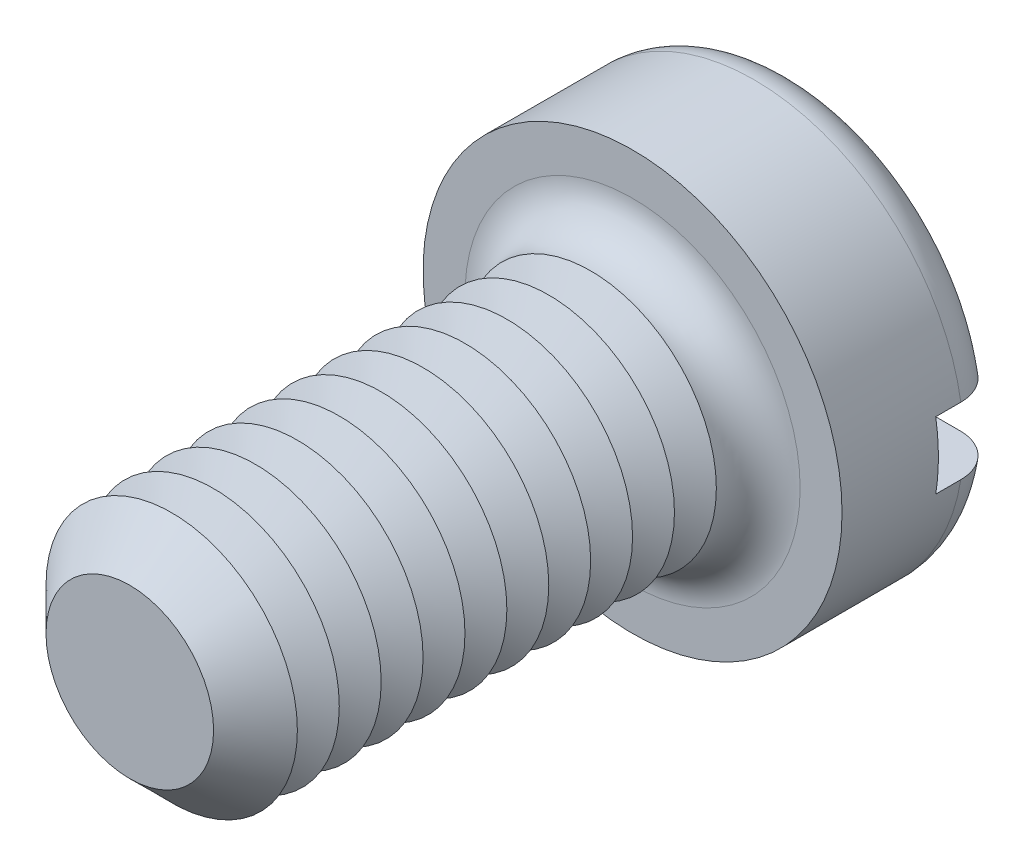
ISO-10303-21;
HEADER;
FILE_DESCRIPTION(('STEP AP214'),'2;1');
FILE_NAME('part.step','',(''),(''),'','','');
FILE_SCHEMA(('AUTOMOTIVE_DESIGN { 1 0 10303 214 1 1 1 1 }'));
ENDSEC;
DATA;
#1=APPLICATION_CONTEXT('core data for automotive mechanical design processes');
#2=APPLICATION_PROTOCOL_DEFINITION('international standard','automotive_design',2000,#1);
#3=PRODUCT_CONTEXT('',#1,'mechanical');
#4=PRODUCT('Part','Part','',(#3));
#5=PRODUCT_RELATED_PRODUCT_CATEGORY('part','',(#4));
#6=PRODUCT_DEFINITION_FORMATION('','',#4);
#7=PRODUCT_DEFINITION_CONTEXT('part definition',#1,'design');
#8=PRODUCT_DEFINITION('design','',#6,#7);
#9=PRODUCT_DEFINITION_SHAPE('','',#8);
#10=(LENGTH_UNIT() NAMED_UNIT(*) SI_UNIT(.MILLI.,.METRE.));
#11=(NAMED_UNIT(*) PLANE_ANGLE_UNIT() SI_UNIT($,.RADIAN.));
#12=(NAMED_UNIT(*) SI_UNIT($,.STERADIAN.) SOLID_ANGLE_UNIT());
#13=UNCERTAINTY_MEASURE_WITH_UNIT(LENGTH_MEASURE(1.E-05),#10,'distance_accuracy_value','');
#14=(GEOMETRIC_REPRESENTATION_CONTEXT(3) GLOBAL_UNCERTAINTY_ASSIGNED_CONTEXT((#13)) GLOBAL_UNIT_ASSIGNED_CONTEXT((#10,
#11,#12)) REPRESENTATION_CONTEXT('',''));
#15=CARTESIAN_POINT('',(0.,0.,0.));
#16=DIRECTION('',(0.,0.,1.));
#17=DIRECTION('',(1.,0.,0.));
#18=AXIS2_PLACEMENT_3D('',#15,#16,#17);
#19=CARTESIAN_POINT('',(0.,0.,-3.9));
#20=DIRECTION('',(0.,0.,1.));
#21=DIRECTION('',(1.,0.,0.));
#22=AXIS2_PLACEMENT_3D('',#19,#20,#21);
#23=PLANE('',#22);
#24=CARTESIAN_POINT('',(0.,0.,-3.9));
#25=DIRECTION('',(0.,0.,1.));
#26=DIRECTION('',(1.,0.,0.));
#27=AXIS2_PLACEMENT_3D('',#24,#25,#26);
#28=CIRCLE('',#27,4.);
#29=CARTESIAN_POINT('',(-3.91918358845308,0.800000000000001,-3.9));
#30=VERTEX_POINT('',#29);
#31=CARTESIAN_POINT('',(3.91918358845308,0.8,-3.9));
#32=VERTEX_POINT('',#31);
#33=EDGE_CURVE('E116',#30,#32,#28,.F.);
#34=ORIENTED_EDGE('',*,*,#33,.T.);
#35=DIRECTION('',(1.,0.,0.));
#36=VECTOR('',#35,1.);
#37=CARTESIAN_POINT('',(-5.,0.800000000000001,-3.9));
#38=LINE('',#37,#36);
#39=EDGE_CURVE('E111',#30,#32,#38,.T.);
#40=ORIENTED_EDGE('',*,*,#39,.F.);
#41=EDGE_LOOP('',(#34,#40));
#42=FACE_BOUND('',#41,.T.);
#43=ADVANCED_FACE('F39',(#42),#23,.F.);
#44=CARTESIAN_POINT('',(0.,0.,-2.9));
#45=DIRECTION('',(0.,0.,1.));
#46=DIRECTION('',(1.,0.,0.));
#47=AXIS2_PLACEMENT_3D('',#44,#45,#46);
#48=TOROIDAL_SURFACE('',#47,4.,1.);
#49=CARTESIAN_POINT('',(-4.76648512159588,0.800000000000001,-3.45304061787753));
#50=CARTESIAN_POINT('',(-4.73486405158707,0.800000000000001,-3.50001565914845));
#51=CARTESIAN_POINT('',(-4.69920787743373,0.800000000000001,-3.54432871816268));
#52=CARTESIAN_POINT('',(-4.62090302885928,0.800000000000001,-3.62634638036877));
#53=CARTESIAN_POINT('',(-4.57824494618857,0.800000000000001,-3.66404194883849));
#54=CARTESIAN_POINT('',(-4.48726975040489,0.800000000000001,-3.73172278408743));
#55=CARTESIAN_POINT('',(-4.43895902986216,0.800000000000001,-3.76171664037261));
#56=CARTESIAN_POINT('',(-4.33804923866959,0.800000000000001,-3.81326437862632));
#57=CARTESIAN_POINT('',(-4.2854512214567,0.800000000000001,-3.8348203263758));
#58=CARTESIAN_POINT('',(-4.17679895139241,0.800000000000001,-3.86918431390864));
#59=CARTESIAN_POINT('',(-4.12071163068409,0.800000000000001,-3.88188775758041));
#60=CARTESIAN_POINT('',(-4.00720729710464,0.800000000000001,-3.89785932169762));
#61=CARTESIAN_POINT('',(-3.94979011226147,0.800000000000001,-3.9011262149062));
#62=CARTESIAN_POINT('',(-3.83429042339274,0.800000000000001,-3.89816676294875));
#63=CARTESIAN_POINT('',(-3.77621176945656,0.800000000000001,-3.89178937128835));
#64=CARTESIAN_POINT('',(-3.66191938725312,0.800000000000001,-3.8694726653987));
#65=CARTESIAN_POINT('',(-3.60570580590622,0.800000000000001,-3.85353259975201));
#66=CARTESIAN_POINT('',(-3.49618749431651,0.800000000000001,-3.81233202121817));
#67=CARTESIAN_POINT('',(-3.44291561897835,0.800000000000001,-3.78698406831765));
#68=CARTESIAN_POINT('',(-3.34140774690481,0.800000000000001,-3.72766098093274));
#69=CARTESIAN_POINT('',(-3.29317182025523,0.800000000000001,-3.69368572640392));
#70=CARTESIAN_POINT('',(-3.20343355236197,0.800000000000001,-3.6182054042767));
#71=CARTESIAN_POINT('',(-3.16189680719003,0.800000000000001,-3.57674128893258));
#72=CARTESIAN_POINT('',(-3.08658236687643,0.800000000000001,-3.48727547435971));
#73=CARTESIAN_POINT('',(-3.05280364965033,0.800000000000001,-3.43927463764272));
#74=CARTESIAN_POINT('',(-2.99489532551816,0.800000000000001,-3.33932895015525));
#75=CARTESIAN_POINT('',(-2.97055012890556,0.800000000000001,-3.28750911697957));
#76=CARTESIAN_POINT('',(-2.93124252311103,0.800000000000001,-3.18042600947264));
#77=CARTESIAN_POINT('',(-2.91627793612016,0.800000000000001,-3.12516353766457));
#78=CARTESIAN_POINT('',(-2.89663075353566,0.800000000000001,-3.01470560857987));
#79=CARTESIAN_POINT('',(-2.89162828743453,0.800000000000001,-2.95956691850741));
#80=CARTESIAN_POINT('',(-2.89112479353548,0.800000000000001,-2.84924961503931));
#81=CARTESIAN_POINT('',(-2.89562264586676,0.800000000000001,-2.79407100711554));
#82=CARTESIAN_POINT('',(-2.91379565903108,0.800000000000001,-2.6861912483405));
#83=CARTESIAN_POINT('',(-2.92731815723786,0.800000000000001,-2.63346424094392));
#84=CARTESIAN_POINT('',(-2.96290888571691,0.800000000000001,-2.53098203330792));
#85=CARTESIAN_POINT('',(-2.98497757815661,0.800000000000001,-2.48122699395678));
#86=CARTESIAN_POINT('',(-3.03728055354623,0.800000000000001,-2.38535286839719));
#87=CARTESIAN_POINT('',(-3.06761989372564,0.800000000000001,-2.33929117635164));
#88=CARTESIAN_POINT('',(-3.13537950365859,0.800000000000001,-2.2527125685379));
#89=CARTESIAN_POINT('',(-3.17280082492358,0.800000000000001,-2.21219647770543));
#90=CARTESIAN_POINT('',(-3.2549164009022,0.800000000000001,-2.13651195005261));
#91=CARTESIAN_POINT('',(-3.29980186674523,0.800000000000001,-2.10155095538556));
#92=CARTESIAN_POINT('',(-3.39467666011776,0.800000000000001,-2.03942270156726));
#93=CARTESIAN_POINT('',(-3.44466673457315,0.800000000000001,-2.01225658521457));
#94=CARTESIAN_POINT('',(-3.5497933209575,0.800000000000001,-1.96576935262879));
#95=CARTESIAN_POINT('',(-3.60503228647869,0.800000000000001,-1.94667963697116));
#96=CARTESIAN_POINT('',(-3.71791613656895,0.800000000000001,-1.91794308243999));
#97=CARTESIAN_POINT('',(-3.77556119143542,0.800000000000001,-1.90829691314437));
#98=CARTESIAN_POINT('',(-3.89221522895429,0.800000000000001,-1.89869331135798));
#99=CARTESIAN_POINT('',(-3.9512319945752,0.800000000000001,-1.89882985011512));
#100=CARTESIAN_POINT('',(-4.06839541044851,0.800000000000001,-1.90907818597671));
#101=CARTESIAN_POINT('',(-4.12654207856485,0.800000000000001,-1.91918977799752));
#102=CARTESIAN_POINT('',(-4.23988103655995,0.800000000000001,-1.9490667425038));
#103=CARTESIAN_POINT('',(-4.29509069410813,0.800000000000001,-1.96876615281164));
#104=CARTESIAN_POINT('',(-4.40134194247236,0.800000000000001,-2.01729572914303));
#105=CARTESIAN_POINT('',(-4.45238383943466,0.800000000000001,-2.04612522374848));
#106=CARTESIAN_POINT('',(-4.54801343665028,0.800000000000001,-2.1116316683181));
#107=CARTESIAN_POINT('',(-4.59268768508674,0.800000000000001,-2.14818225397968));
#108=CARTESIAN_POINT('',(-4.67513924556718,0.800000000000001,-2.22837632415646));
#109=CARTESIAN_POINT('',(-4.71291715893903,0.800000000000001,-2.27201918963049));
#110=CARTESIAN_POINT('',(-4.77986554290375,0.800000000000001,-2.36439990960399));
#111=CARTESIAN_POINT('',(-4.80916462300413,0.800000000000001,-2.41304457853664));
#112=CARTESIAN_POINT('',(-4.85906149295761,0.800000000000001,-2.51460659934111));
#113=CARTESIAN_POINT('',(-4.8796602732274,0.800000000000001,-2.56752346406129));
#114=CARTESIAN_POINT('',(-4.9113264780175,0.800000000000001,-2.67542592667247));
#115=CARTESIAN_POINT('',(-4.92250819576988,0.800000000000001,-2.73037800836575));
#116=CARTESIAN_POINT('',(-4.93542682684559,0.800000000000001,-2.84139649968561));
#117=CARTESIAN_POINT('',(-4.93716171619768,0.800000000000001,-2.89746314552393));
#118=CARTESIAN_POINT('',(-4.93114851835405,0.800000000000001,-3.00876455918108));
#119=CARTESIAN_POINT('',(-4.92345325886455,0.800000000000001,-3.0640022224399));
#120=CARTESIAN_POINT('',(-4.8989032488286,0.800000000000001,-3.17235240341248));
#121=CARTESIAN_POINT('',(-4.88205998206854,0.800000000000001,-3.22546749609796));
#122=CARTESIAN_POINT('',(-4.84819200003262,0.800000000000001,-3.30764066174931));
#123=CARTESIAN_POINT('',(-4.83390853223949,0.800000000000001,-3.33785845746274));
#124=CARTESIAN_POINT('',(-4.80237957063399,0.800000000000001,-3.39670633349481));
#125=CARTESIAN_POINT('',(-4.78513409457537,0.800000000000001,-3.42533642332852));
#126=CARTESIAN_POINT('',(-4.76648512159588,0.800000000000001,-3.45304061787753));
#127=B_SPLINE_CURVE_WITH_KNOTS('',3,(#49,#50,#51,#52,#53,#54,#55,#56,#57,#58,#59,#60,#61,#62,
#63,#64,#65,#66,#67,#68,#69,#70,#71,#72,#73,#74,#75,#76,#77,#78,#79,#80,#81,#82,#83,#84,#85,#86,
#87,#88,#89,#90,#91,#92,#93,#94,#95,#96,#97,#98,#99,#100,#101,#102,#103,#104,#105,#106,#107,
#108,#109,#110,#111,#112,#113,#114,#115,#116,#117,#118,#119,#120,#121,#122,#123,#124,#125,#126),
.UNSPECIFIED.,.T.,.F.,(4,2,2,2,2,2,2,2,2,2,2,2,2,2,2,2,2,2,2,2,2,2,2,2,2,2,2,2,2,2,2,2,2,2,2,2,
2,2,4),(0.,0.169755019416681,0.339740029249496,0.509534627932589,0.67928763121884,
0.851013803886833,1.02276230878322,1.19722869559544,1.37170879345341,1.54785292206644,
1.72399950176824,1.89921049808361,2.07439839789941,2.24530597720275,2.41617386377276,
2.58146078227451,2.74672821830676,2.90926852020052,3.0718176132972,3.2365363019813,
3.40127946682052,3.57118676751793,3.74111896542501,3.91563534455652,4.09016409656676,
4.26636956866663,4.4425714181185,4.61757781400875,4.79257134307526,4.96489650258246,
5.13720662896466,5.30674670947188,5.47626748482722,5.64369988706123,5.81116816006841,
5.97770254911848,6.14402836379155,6.24414438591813,6.34425980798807),.UNSPECIFIED.);
#128=CARTESIAN_POINT('',(-4.93558507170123,0.800000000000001,-2.9));
#129=VERTEX_POINT('',#128);
#130=EDGE_CURVE('E258',#129,#30,#127,.T.);
#131=ORIENTED_EDGE('',*,*,#130,.F.);
#132=CARTESIAN_POINT('',(0.,0.,-2.9));
#133=DIRECTION('',(0.,0.,1.));
#134=DIRECTION('',(1.,0.,0.));
#135=AXIS2_PLACEMENT_3D('',#132,#133,#134);
#136=CIRCLE('',#135,5.);
#137=CARTESIAN_POINT('',(4.93558507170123,0.8,-2.9));
#138=VERTEX_POINT('',#137);
#139=EDGE_CURVE('E124',#138,#129,#136,.T.);
#140=ORIENTED_EDGE('',*,*,#139,.F.);
#141=CARTESIAN_POINT('',(2.98553785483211,0.8,-3.31649797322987));
#142=CARTESIAN_POINT('',(3.00991125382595,0.8,-3.36788093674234));
#143=CARTESIAN_POINT('',(3.03875556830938,0.8,-3.41719756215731));
#144=CARTESIAN_POINT('',(3.1043993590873,0.8,-3.51028676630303));
#145=CARTESIAN_POINT('',(3.1412115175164,0.8,-3.55405032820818));
#146=CARTESIAN_POINT('',(3.22153641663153,0.8,-3.63476402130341));
#147=CARTESIAN_POINT('',(3.26503706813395,0.8,-3.67172618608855));
#148=CARTESIAN_POINT('',(3.35749627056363,0.8,-3.73799476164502));
#149=CARTESIAN_POINT('',(3.4064533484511,0.8,-3.76730323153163));
#150=CARTESIAN_POINT('',(3.5095773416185,0.8,-3.81809642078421));
#151=CARTESIAN_POINT('',(3.56383317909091,0.8,-3.83940072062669));
#152=CARTESIAN_POINT('',(3.67513017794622,0.8,-3.87272481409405));
#153=CARTESIAN_POINT('',(3.7321717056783,0.8,-3.88474338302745));
#154=CARTESIAN_POINT('',(3.84815688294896,0.8,-3.89923413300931));
#155=CARTESIAN_POINT('',(3.90711516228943,0.8,-3.9015896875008));
#156=CARTESIAN_POINT('',(4.02458610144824,0.8,-3.89631753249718));
#157=CARTESIAN_POINT('',(4.08309876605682,0.8,-3.8886899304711));
#158=CARTESIAN_POINT('',(4.19768646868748,0.8,-3.86366584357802));
#159=CARTESIAN_POINT('',(4.25377243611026,0.8,-3.84631948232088));
#160=CARTESIAN_POINT('',(4.3621676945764,0.8,-3.80231797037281));
#161=CARTESIAN_POINT('',(4.41447726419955,0.8,-3.77566350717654));
#162=CARTESIAN_POINT('',(4.51300872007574,0.8,-3.71421163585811));
#163=CARTESIAN_POINT('',(4.5593085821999,0.8,-3.67953927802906));
#164=CARTESIAN_POINT('',(4.64530675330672,0.8,-3.60279495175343));
#165=CARTESIAN_POINT('',(4.68500564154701,0.8,-3.56072363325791));
#166=CARTESIAN_POINT('',(4.75599202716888,0.8,-3.47111750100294));
#167=CARTESIAN_POINT('',(4.7874061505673,0.8,-3.42368298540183));
#168=CARTESIAN_POINT('',(4.84170328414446,0.8,-3.32415927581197));
#169=CARTESIAN_POINT('',(4.86458695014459,0.8,-3.2720704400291));
#170=CARTESIAN_POINT('',(4.90088120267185,0.8,-3.16544016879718));
#171=CARTESIAN_POINT('',(4.91440984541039,0.8,-3.11093889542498));
#172=CARTESIAN_POINT('',(4.93205429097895,0.8,-3.00043391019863));
#173=CARTESIAN_POINT('',(4.93617053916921,0.8,-2.9444302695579));
#174=CARTESIAN_POINT('',(4.93486973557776,0.8,-2.83292218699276));
#175=CARTESIAN_POINT('',(4.92951827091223,0.8,-2.77741696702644));
#176=CARTESIAN_POINT('',(4.90957104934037,0.8,-2.66809456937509));
#177=CARTESIAN_POINT('',(4.89497541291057,0.8,-2.61427736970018));
#178=CARTESIAN_POINT('',(4.85697876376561,0.8,-2.50985095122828));
#179=CARTESIAN_POINT('',(4.83357805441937,0.8,-2.45924162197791));
#180=CARTESIAN_POINT('',(4.77866660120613,0.8,-2.36263484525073));
#181=CARTESIAN_POINT('',(4.74715567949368,0.8,-2.31663749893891));
#182=CARTESIAN_POINT('',(4.67670791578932,0.8,-2.23021464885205));
#183=CARTESIAN_POINT('',(4.6377224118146,0.8,-2.1898288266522));
#184=CARTESIAN_POINT('',(4.55359880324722,0.8,-2.11607828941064));
#185=CARTESIAN_POINT('',(4.50846036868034,0.8,-2.08271395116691));
#186=CARTESIAN_POINT('',(4.41271544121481,0.8,-2.02349513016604));
#187=CARTESIAN_POINT('',(4.36204749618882,0.8,-1.99774003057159));
#188=CARTESIAN_POINT('',(4.257155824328,0.8,-1.95495040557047));
#189=CARTESIAN_POINT('',(4.20293181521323,0.8,-1.93791657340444));
#190=CARTESIAN_POINT('',(4.09154156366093,0.8,-1.91276335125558));
#191=CARTESIAN_POINT('',(4.03434212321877,0.8,-1.90479098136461));
#192=CARTESIAN_POINT('',(3.91941228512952,0.8,-1.89840884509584));
#193=CARTESIAN_POINT('',(3.8616818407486,0.8,-1.89999992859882));
#194=CARTESIAN_POINT('',(3.7464111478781,0.8,-1.91275144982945));
#195=CARTESIAN_POINT('',(3.6888866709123,0.8,-1.92405471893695));
#196=CARTESIAN_POINT('',(3.57652290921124,0.8,-1.95609086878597));
#197=CARTESIAN_POINT('',(3.52168382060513,0.8,-1.97682443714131));
#198=CARTESIAN_POINT('',(3.41589179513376,0.8,-2.02733294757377));
#199=CARTESIAN_POINT('',(3.36496676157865,0.8,-2.05716640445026));
#200=CARTESIAN_POINT('',(3.26890903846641,0.8,-2.12504079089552));
#201=CARTESIAN_POINT('',(3.22377627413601,0.8,-2.16308161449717));
#202=CARTESIAN_POINT('',(3.141135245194,0.8,-2.24593284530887));
#203=CARTESIAN_POINT('',(3.1035541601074,0.8,-2.29067053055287));
#204=CARTESIAN_POINT('',(3.03669700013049,0.8,-2.38597317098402));
#205=CARTESIAN_POINT('',(3.00741914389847,0.8,-2.43653687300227));
#206=CARTESIAN_POINT('',(2.95891799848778,0.8,-2.54052959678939));
#207=CARTESIAN_POINT('',(2.93943249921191,0.8,-2.59383627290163));
#208=CARTESIAN_POINT('',(2.9100081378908,0.8,-2.70303736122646));
#209=CARTESIAN_POINT('',(2.90006970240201,0.8,-2.75893188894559));
#210=CARTESIAN_POINT('',(2.89027863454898,0.8,-2.86986958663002));
#211=CARTESIAN_POINT('',(2.89012791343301,0.8,-2.92488680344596));
#212=CARTESIAN_POINT('',(2.89917145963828,0.8,-3.03409648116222));
#213=CARTESIAN_POINT('',(2.90835313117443,0.8,-3.08828995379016));
#214=CARTESIAN_POINT('',(2.92977618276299,0.8,-3.17141652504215));
#215=CARTESIAN_POINT('',(2.93899011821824,0.8,-3.20116372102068));
#216=CARTESIAN_POINT('',(2.96020249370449,0.8,-3.25964614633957));
#217=CARTESIAN_POINT('',(2.97220082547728,0.8,-3.28838141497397));
#218=CARTESIAN_POINT('',(2.98553785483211,0.8,-3.31649797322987));
#219=B_SPLINE_CURVE_WITH_KNOTS('',3,(#141,#142,#143,#144,#145,#146,#147,#148,#149,#150,#151,
#152,#153,#154,#155,#156,#157,#158,#159,#160,#161,#162,#163,#164,#165,#166,#167,#168,#169,#170,
#171,#172,#173,#174,#175,#176,#177,#178,#179,#180,#181,#182,#183,#184,#185,#186,#187,#188,#189,
#190,#191,#192,#193,#194,#195,#196,#197,#198,#199,#200,#201,#202,#203,#204,#205,#206,#207,#208,
#209,#210,#211,#212,#213,#214,#215,#216,#217,#218),.UNSPECIFIED.,.T.,.F.,(4,2,2,2,2,2,2,2,2,2,2,
2,2,2,2,2,2,2,2,2,2,2,2,2,2,2,2,2,2,2,2,2,2,2,2,2,2,2,4),(0.,0.170493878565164,
0.341261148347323,0.511723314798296,0.682139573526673,0.856194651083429,1.03027268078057,
1.20644565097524,1.38261672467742,1.55788746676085,1.73314526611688,1.90583484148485,
2.07850925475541,2.24836742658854,2.41821253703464,2.58587311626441,2.75352576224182,
2.92002154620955,3.08651516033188,3.25300303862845,3.41949456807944,3.58710926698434,
3.75473295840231,3.92445790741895,4.09419634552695,4.26665110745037,4.43912119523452,
4.61417197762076,4.78923552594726,4.96544940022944,5.1416609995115,5.31608191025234,
5.49046537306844,5.65989063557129,5.82932346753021,5.99359365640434,6.157642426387,
6.250939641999,6.34423323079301),.UNSPECIFIED.);
#220=EDGE_CURVE('E260',#32,#138,#219,.T.);
#221=ORIENTED_EDGE('',*,*,#220,.F.);
#222=ORIENTED_EDGE('',*,*,#33,.F.);
#223=EDGE_LOOP('',(#131,#140,#221,#222));
#224=FACE_BOUND('',#223,.T.);
#225=ADVANCED_FACE('F242',(#224),#48,.T.);
#226=CARTESIAN_POINT('',(0.,0.,-3.9));
#227=DIRECTION('',(0.,0.,1.));
#228=DIRECTION('',(1.,0.,0.));
#229=AXIS2_PLACEMENT_3D('',#226,#227,#228);
#230=CYLINDRICAL_SURFACE('',#229,5.);
#231=DIRECTION('',(0.,0.,1.));
#232=VECTOR('',#231,1.);
#233=CARTESIAN_POINT('',(4.93558507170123,0.8,-3.9));
#234=LINE('',#233,#232);
#235=CARTESIAN_POINT('',(4.93558507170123,0.8,-2.3));
#236=VERTEX_POINT('',#235);
#237=EDGE_CURVE('E275',#138,#236,#234,.T.);
#238=ORIENTED_EDGE('',*,*,#237,.F.);
#239=ORIENTED_EDGE('',*,*,#139,.T.);
#240=DIRECTION('',(0.,0.,1.));
#241=VECTOR('',#240,1.);
#242=CARTESIAN_POINT('',(-4.93558507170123,0.800000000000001,-3.9));
#243=LINE('',#242,#241);
#244=CARTESIAN_POINT('',(-4.93558507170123,0.800000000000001,-2.3));
#245=VERTEX_POINT('',#244);
#246=EDGE_CURVE('E63',#245,#129,#243,.F.);
#247=ORIENTED_EDGE('',*,*,#246,.F.);
#248=CARTESIAN_POINT('',(0.,0.,-2.3));
#249=DIRECTION('',(0.,0.,-1.));
#250=DIRECTION('',(-1.,0.,0.));
#251=AXIS2_PLACEMENT_3D('',#248,#249,#250);
#252=CIRCLE('',#251,5.);
#253=CARTESIAN_POINT('',(-4.93558507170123,-0.799999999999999,-2.3));
#254=VERTEX_POINT('',#253);
#255=EDGE_CURVE('E43',#245,#254,#252,.F.);
#256=ORIENTED_EDGE('',*,*,#255,.T.);
#257=DIRECTION('',(0.,0.,1.));
#258=VECTOR('',#257,1.);
#259=CARTESIAN_POINT('',(-4.93558507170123,-0.799999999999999,-3.9));
#260=LINE('',#259,#258);
#261=CARTESIAN_POINT('',(-4.93558507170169,-0.799999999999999,-2.89999999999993));
#262=VERTEX_POINT('',#261);
#263=EDGE_CURVE('E272',#262,#254,#260,.T.);
#264=ORIENTED_EDGE('',*,*,#263,.F.);
#265=CARTESIAN_POINT('',(4.93558507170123,-0.8,-2.9));
#266=VERTEX_POINT('',#265);
#267=EDGE_CURVE('E126',#262,#266,#136,.T.);
#268=ORIENTED_EDGE('',*,*,#267,.T.);
#269=DIRECTION('',(0.,0.,1.));
#270=VECTOR('',#269,1.);
#271=CARTESIAN_POINT('',(4.93558507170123,-0.8,-3.9));
#272=LINE('',#271,#270);
#273=CARTESIAN_POINT('',(4.93558507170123,-0.8,-2.3));
#274=VERTEX_POINT('',#273);
#275=EDGE_CURVE('E55',#274,#266,#272,.F.);
#276=ORIENTED_EDGE('',*,*,#275,.F.);
#277=EDGE_CURVE('E11',#274,#236,#252,.F.);
#278=ORIENTED_EDGE('',*,*,#277,.T.);
#279=EDGE_LOOP('',(#238,#239,#247,#256,#264,#268,#276,#278));
#280=FACE_BOUND('',#279,.T.);
#281=CARTESIAN_POINT('',(0.,0.,0.));
#282=DIRECTION('',(0.,0.,1.));
#283=DIRECTION('',(1.,0.,0.));
#284=AXIS2_PLACEMENT_3D('',#281,#282,#283);
#285=CIRCLE('',#284,5.);
#286=CARTESIAN_POINT('',(5.,0.,0.));
#287=VERTEX_POINT('',#286);
#288=EDGE_CURVE('E278',#287,#287,#285,.T.);
#289=ORIENTED_EDGE('',*,*,#288,.F.);
#290=EDGE_LOOP('',(#289));
#291=FACE_BOUND('',#290,.T.);
#292=ADVANCED_FACE('F238',(#280,#291),#230,.T.);
#293=CARTESIAN_POINT('',(3.91918358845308,-0.8,-3.9));
#294=VERTEX_POINT('',#293);
#295=CARTESIAN_POINT('',(-3.91918358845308,-0.799999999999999,-3.9));
#296=VERTEX_POINT('',#295);
#297=EDGE_CURVE('E109',#294,#296,#28,.F.);
#298=ORIENTED_EDGE('',*,*,#297,.T.);
#299=DIRECTION('',(-1.,0.,0.));
#300=VECTOR('',#299,1.);
#301=CARTESIAN_POINT('',(-5.,-0.799999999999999,-3.9));
#302=LINE('',#301,#300);
#303=EDGE_CURVE('E96',#294,#296,#302,.T.);
#304=ORIENTED_EDGE('',*,*,#303,.F.);
#305=EDGE_LOOP('',(#298,#304));
#306=FACE_BOUND('',#305,.T.);
#307=ADVANCED_FACE('F108',(#306),#23,.F.);
#308=CARTESIAN_POINT('',(0.,0.,0.));
#309=DIRECTION('',(0.,0.,1.));
#310=DIRECTION('',(1.,0.,0.));
#311=AXIS2_PLACEMENT_3D('',#308,#309,#310);
#312=PLANE('',#311);
#313=CARTESIAN_POINT('',(0.,0.,0.));
#314=DIRECTION('',(0.,0.,1.));
#315=DIRECTION('',(1.,0.,0.));
#316=AXIS2_PLACEMENT_3D('',#313,#314,#315);
#317=CIRCLE('',#316,4.);
#318=CARTESIAN_POINT('',(4.,0.,0.));
#319=VERTEX_POINT('',#318);
#320=EDGE_CURVE('E115',#319,#319,#317,.F.);
#321=ORIENTED_EDGE('',*,*,#320,.T.);
#322=EDGE_LOOP('',(#321));
#323=FACE_BOUND('',#322,.T.);
#324=ORIENTED_EDGE('',*,*,#288,.T.);
#325=EDGE_LOOP('',(#324));
#326=FACE_BOUND('',#325,.T.);
#327=ADVANCED_FACE('F237',(#323,#326),#312,.T.);
#328=CARTESIAN_POINT('',(-4.76648512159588,-0.799999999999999,-3.45304061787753));
#329=CARTESIAN_POINT('',(-4.7975694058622,-0.799999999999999,-3.40685392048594));
#330=CARTESIAN_POINT('',(-4.82479903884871,-0.799999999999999,-3.35802740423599));
#331=CARTESIAN_POINT('',(-4.87070632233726,-0.799999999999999,-3.25646127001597));
#332=CARTESIAN_POINT('',(-4.8893747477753,-0.799999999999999,-3.20371750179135));
#333=CARTESIAN_POINT('',(-4.91756720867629,-0.799999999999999,-3.09584501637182));
#334=CARTESIAN_POINT('',(-4.92709302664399,-0.799999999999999,-3.04071676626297));
#335=CARTESIAN_POINT('',(-4.93671217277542,-0.799999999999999,-2.92965669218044));
#336=CARTESIAN_POINT('',(-4.93680767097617,-0.799999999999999,-2.87372505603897));
#337=CARTESIAN_POINT('',(-4.92758675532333,-0.799999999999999,-2.76284675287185));
#338=CARTESIAN_POINT('',(-4.91830421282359,-0.799999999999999,-2.70789726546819));
#339=CARTESIAN_POINT('',(-4.89065741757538,-0.799999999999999,-2.60033228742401));
#340=CARTESIAN_POINT('',(-4.87229291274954,-0.799999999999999,-2.54771686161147));
#341=CARTESIAN_POINT('',(-4.82699855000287,-0.799999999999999,-2.44622441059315));
#342=CARTESIAN_POINT('',(-4.80005659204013,-0.799999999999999,-2.39735278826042));
#343=CARTESIAN_POINT('',(-4.73841244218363,-0.799999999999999,-2.30477947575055));
#344=CARTESIAN_POINT('',(-4.70371003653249,-0.799999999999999,-2.26107792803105));
#345=CARTESIAN_POINT('',(-4.62724516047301,-0.799999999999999,-2.17969334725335));
#346=CARTESIAN_POINT('',(-4.58542787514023,-0.799999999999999,-2.14206183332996));
#347=CARTESIAN_POINT('',(-4.49614171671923,-0.799999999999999,-2.07424284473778));
#348=CARTESIAN_POINT('',(-4.44867251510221,-0.799999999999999,-2.04405580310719));
#349=CARTESIAN_POINT('',(-4.34875035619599,-0.799999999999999,-1.99153688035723));
#350=CARTESIAN_POINT('',(-4.29623870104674,-0.799999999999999,-1.96931670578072));
#351=CARTESIAN_POINT('',(-4.18826905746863,-0.799999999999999,-1.93384994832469));
#352=CARTESIAN_POINT('',(-4.1328108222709,-0.799999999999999,-1.92060411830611));
#353=CARTESIAN_POINT('',(-4.01956054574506,-0.799999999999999,-1.90323798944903));
#354=CARTESIAN_POINT('',(-3.96174522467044,-0.799999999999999,-1.89926947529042));
#355=CARTESIAN_POINT('',(-3.84625419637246,-0.799999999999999,-1.90095183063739));
#356=CARTESIAN_POINT('',(-3.78857850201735,-0.799999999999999,-1.90660355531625));
#357=CARTESIAN_POINT('',(-3.67415602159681,-0.799999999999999,-1.92748272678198));
#358=CARTESIAN_POINT('',(-3.61743328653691,-0.799999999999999,-1.94284216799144));
#359=CARTESIAN_POINT('',(-3.50734962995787,-0.799999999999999,-1.9828275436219));
#360=CARTESIAN_POINT('',(-3.4539889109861,-0.799999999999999,-2.00745403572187));
#361=CARTESIAN_POINT('',(-3.35197118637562,-0.799999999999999,-2.06542964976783));
#362=CARTESIAN_POINT('',(-3.30333217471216,-0.799999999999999,-2.0988104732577));
#363=CARTESIAN_POINT('',(-3.21244692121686,-0.799999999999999,-2.17337326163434));
#364=CARTESIAN_POINT('',(-3.17020039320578,-0.799999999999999,-2.21455487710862));
#365=CARTESIAN_POINT('',(-3.0940098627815,-0.799999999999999,-2.30296695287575));
#366=CARTESIAN_POINT('',(-3.05995540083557,-0.799999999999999,-2.35010211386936));
#367=CARTESIAN_POINT('',(-3.00053815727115,-0.799999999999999,-2.4495670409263));
#368=CARTESIAN_POINT('',(-2.97517362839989,-0.799999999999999,-2.50189576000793));
#369=CARTESIAN_POINT('',(-2.93470320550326,-0.799999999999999,-2.60853979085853));
#370=CARTESIAN_POINT('',(-2.91930557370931,-0.799999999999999,-2.66274437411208));
#371=CARTESIAN_POINT('',(-2.89812734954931,-0.799999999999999,-2.77299836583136));
#372=CARTESIAN_POINT('',(-2.89234481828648,-0.799999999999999,-2.82904740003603));
#373=CARTESIAN_POINT('',(-2.89064073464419,-0.799999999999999,-2.93970612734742));
#374=CARTESIAN_POINT('',(-2.89444549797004,-0.799999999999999,-2.99431180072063));
#375=CARTESIAN_POINT('',(-2.9112006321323,-0.799999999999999,-3.10209766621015));
#376=CARTESIAN_POINT('',(-2.9241507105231,-0.799999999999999,-3.1552779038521));
#377=CARTESIAN_POINT('',(-2.95868580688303,-0.799999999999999,-3.25858631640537));
#378=CARTESIAN_POINT('',(-2.98024709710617,-0.799999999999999,-3.30872244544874));
#379=CARTESIAN_POINT('',(-3.03128544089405,-0.799999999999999,-3.40478519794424));
#380=CARTESIAN_POINT('',(-3.06076335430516,-0.799999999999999,-3.45071136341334));
#381=CARTESIAN_POINT('',(-3.12753448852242,-0.799999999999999,-3.53826932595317));
#382=CARTESIAN_POINT('',(-3.16500083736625,-0.799999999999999,-3.57976901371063));
#383=CARTESIAN_POINT('',(-3.24617503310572,-0.799999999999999,-3.65613204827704));
#384=CARTESIAN_POINT('',(-3.28988388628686,-0.799999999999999,-3.69099432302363));
#385=CARTESIAN_POINT('',(-3.38380639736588,-0.799999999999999,-3.75424083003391));
#386=CARTESIAN_POINT('',(-3.43418287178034,-0.799999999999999,-3.78238342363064));
#387=CARTESIAN_POINT('',(-3.53887888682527,-0.799999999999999,-3.83000231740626));
#388=CARTESIAN_POINT('',(-3.59319889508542,-0.799999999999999,-3.84947758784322));
#389=CARTESIAN_POINT('',(-3.70539237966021,-0.799999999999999,-3.87954336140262));
#390=CARTESIAN_POINT('',(-3.76331464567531,-0.799999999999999,-3.88995217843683));
#391=CARTESIAN_POINT('',(-3.88008461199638,-0.799999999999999,-3.9009132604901));
#392=CARTESIAN_POINT('',(-3.93893230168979,-0.799999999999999,-3.9014656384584));
#393=CARTESIAN_POINT('',(-4.05594892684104,-0.799999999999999,-3.89264187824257));
#394=CARTESIAN_POINT('',(-4.11411702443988,-0.799999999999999,-3.88325457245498));
#395=CARTESIAN_POINT('',(-4.22802928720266,-0.799999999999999,-3.85472582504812));
#396=CARTESIAN_POINT('',(-4.28377297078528,-0.799999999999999,-3.83558245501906));
#397=CARTESIAN_POINT('',(-4.39054463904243,-0.799999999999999,-3.78829842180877));
#398=CARTESIAN_POINT('',(-4.44161887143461,-0.799999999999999,-3.76026208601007));
#399=CARTESIAN_POINT('',(-4.53818016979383,-0.799999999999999,-3.69589278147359));
#400=CARTESIAN_POINT('',(-4.58367442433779,-0.799999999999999,-3.65957066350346));
#401=CARTESIAN_POINT('',(-4.65208830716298,-0.799999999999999,-3.59453310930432));
#402=CARTESIAN_POINT('',(-4.67711825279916,-0.799999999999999,-3.56800018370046));
#403=CARTESIAN_POINT('',(-4.72414423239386,-0.799999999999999,-3.51236863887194));
#404=CARTESIAN_POINT('',(-4.74614029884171,-0.799999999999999,-3.48327004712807));
#405=CARTESIAN_POINT('',(-4.76648512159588,-0.799999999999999,-3.45304061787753));
#406=B_SPLINE_CURVE_WITH_KNOTS('',3,(#328,#329,#330,#331,#332,#333,#334,#335,#336,#337,#338,
#339,#340,#341,#342,#343,#344,#345,#346,#347,#348,#349,#350,#351,#352,#353,#354,#355,#356,#357,
#358,#359,#360,#361,#362,#363,#364,#365,#366,#367,#368,#369,#370,#371,#372,#373,#374,#375,#376,
#377,#378,#379,#380,#381,#382,#383,#384,#385,#386,#387,#388,#389,#390,#391,#392,#393,#394,#395,
#396,#397,#398,#399,#400,#401,#402,#403,#404,#405),.UNSPECIFIED.,.T.,.F.,(4,2,2,2,2,2,2,2,2,2,2,
2,2,2,2,2,2,2,2,2,2,2,2,2,2,2,2,2,2,2,2,2,2,2,2,2,2,2,4),(0.,0.166886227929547,
0.333951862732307,0.500984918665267,0.667979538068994,0.834373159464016,1.00077139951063,
1.16740542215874,1.33404403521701,1.50202999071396,1.67002571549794,1.84029248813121,
2.01057354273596,2.18362161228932,2.35668506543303,2.53215380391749,2.70763310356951,
2.88375684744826,3.05987270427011,3.23346085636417,3.40701408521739,3.57522519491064,
3.74340238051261,3.90683338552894,4.0702591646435,4.23323770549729,4.39623395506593,
4.56320691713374,4.7302068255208,4.90252468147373,5.07486300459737,5.25058028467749,
5.42629555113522,5.60220844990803,5.77815613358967,5.95211162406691,6.12584060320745,
6.23506966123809,6.34429754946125),.UNSPECIFIED.);
#407=EDGE_CURVE('E103',#296,#262,#406,.T.);
#408=ORIENTED_EDGE('',*,*,#407,.F.);
#409=ORIENTED_EDGE('',*,*,#297,.F.);
#410=CARTESIAN_POINT('',(2.98553785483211,-0.8,-3.31649797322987));
#411=CARTESIAN_POINT('',(2.96216773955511,-0.8,-3.26721849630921));
#412=CARTESIAN_POINT('',(2.94287503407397,-0.8,-3.21596872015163));
#413=CARTESIAN_POINT('',(2.91313258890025,-0.8,-3.11092723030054));
#414=CARTESIAN_POINT('',(2.9026902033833,-0.8,-3.0571334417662));
#415=CARTESIAN_POINT('',(2.89104377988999,-0.8,-2.94853922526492));
#416=CARTESIAN_POINT('',(2.88984130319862,-0.8,-2.89373862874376));
#417=CARTESIAN_POINT('',(2.89672585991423,-0.8,-2.78473646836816));
#418=CARTESIAN_POINT('',(2.90481120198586,-0.8,-2.73053479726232));
#419=CARTESIAN_POINT('',(2.92989134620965,-0.8,-2.62460092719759));
#420=CARTESIAN_POINT('',(2.94682969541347,-0.8,-2.57285532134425));
#421=CARTESIAN_POINT('',(2.9889990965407,-0.8,-2.47286425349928));
#422=CARTESIAN_POINT('',(3.01423103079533,-0.8,-2.42461916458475));
#423=CARTESIAN_POINT('',(3.07271536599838,-0.8,-2.33201565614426));
#424=CARTESIAN_POINT('',(3.10610710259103,-0.8,-2.28774532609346));
#425=CARTESIAN_POINT('',(3.17963417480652,-0.8,-2.205215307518));
#426=CARTESIAN_POINT('',(3.21977054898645,-0.8,-2.16695654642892));
#427=CARTESIAN_POINT('',(3.3070361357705,-0.8,-2.09624274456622));
#428=CARTESIAN_POINT('',(3.35434874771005,-0.8,-2.06401396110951));
#429=CARTESIAN_POINT('',(3.45361131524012,-0.8,-2.00773436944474));
#430=CARTESIAN_POINT('',(3.50556189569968,-0.8,-1.98368466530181));
#431=CARTESIAN_POINT('',(3.61398433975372,-0.8,-1.94389460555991));
#432=CARTESIAN_POINT('',(3.67053506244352,-0.8,-1.92836880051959));
#433=CARTESIAN_POINT('',(3.78543606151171,-0.8,-1.90696594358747));
#434=CARTESIAN_POINT('',(3.84378643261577,-0.8,-1.90108940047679));
#435=CARTESIAN_POINT('',(3.96100201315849,-0.8,-1.89918115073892));
#436=CARTESIAN_POINT('',(4.01986821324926,-0.8,-1.90320860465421));
#437=CARTESIAN_POINT('',(4.13606891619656,-0.8,-1.9211820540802));
#438=CARTESIAN_POINT('',(4.19340347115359,-0.8,-1.93512771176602));
#439=CARTESIAN_POINT('',(4.30434213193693,-0.8,-1.97243705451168));
#440=CARTESIAN_POINT('',(4.35797549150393,-0.8,-1.99571368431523));
#441=CARTESIAN_POINT('',(4.46048254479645,-0.8,-2.0510826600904));
#442=CARTESIAN_POINT('',(4.50935662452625,-0.8,-2.08317429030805));
#443=CARTESIAN_POINT('',(4.60012348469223,-0.8,-2.15471647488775));
#444=CARTESIAN_POINT('',(4.64211506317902,-0.8,-2.19404167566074));
#445=CARTESIAN_POINT('',(4.71877054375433,-0.8,-2.27928299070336));
#446=CARTESIAN_POINT('',(4.75343508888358,-0.8,-2.32519852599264));
#447=CARTESIAN_POINT('',(4.81388799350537,-0.8,-2.4215411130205));
#448=CARTESIAN_POINT('',(4.83980652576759,-0.8,-2.47188650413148));
#449=CARTESIAN_POINT('',(4.88271402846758,-0.8,-2.57624865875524));
#450=CARTESIAN_POINT('',(4.89970360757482,-0.8,-2.63026517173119));
#451=CARTESIAN_POINT('',(4.92409334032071,-0.8,-2.73978844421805));
#452=CARTESIAN_POINT('',(4.93159814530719,-0.8,-2.79527191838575));
#453=CARTESIAN_POINT('',(4.93713723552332,-0.8,-2.90670881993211));
#454=CARTESIAN_POINT('',(4.9351718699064,-0.8,-2.9626622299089));
#455=CARTESIAN_POINT('',(4.92186293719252,-0.8,-3.07317093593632));
#456=CARTESIAN_POINT('',(4.91056393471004,-0.8,-3.12773160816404));
#457=CARTESIAN_POINT('',(4.87898532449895,-0.8,-3.234187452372));
#458=CARTESIAN_POINT('',(4.85870572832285,-0.8,-3.28608262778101));
#459=CARTESIAN_POINT('',(4.80971634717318,-0.8,-3.38586723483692));
#460=CARTESIAN_POINT('',(4.78098824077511,-0.8,-3.43374766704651));
#461=CARTESIAN_POINT('',(4.71596686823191,-0.8,-3.52405937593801));
#462=CARTESIAN_POINT('',(4.67967336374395,-0.8,-3.56649048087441));
#463=CARTESIAN_POINT('',(4.60022577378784,-0.8,-3.64511036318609));
#464=CARTESIAN_POINT('',(4.5570143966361,-0.8,-3.6812412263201));
#465=CARTESIAN_POINT('',(4.4652099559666,-0.8,-3.7458530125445));
#466=CARTESIAN_POINT('',(4.41661654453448,-0.8,-3.77433344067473));
#467=CARTESIAN_POINT('',(4.31470683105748,-0.8,-3.82326981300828));
#468=CARTESIAN_POINT('',(4.26133399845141,-0.8,-3.84360800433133));
#469=CARTESIAN_POINT('',(4.15196444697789,-0.8,-3.87519515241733));
#470=CARTESIAN_POINT('',(4.09596750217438,-0.8,-3.88644332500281));
#471=CARTESIAN_POINT('',(3.98196469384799,-0.8,-3.89971870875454));
#472=CARTESIAN_POINT('',(3.92394096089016,-0.8,-3.901592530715));
#473=CARTESIAN_POINT('',(3.8083852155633,-0.8,-3.89570840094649));
#474=CARTESIAN_POINT('',(3.75085322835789,-0.8,-3.88794995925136));
#475=CARTESIAN_POINT('',(3.6371167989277,-0.8,-3.86287824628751));
#476=CARTESIAN_POINT('',(3.58093962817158,-0.8,-3.84544111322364));
#477=CARTESIAN_POINT('',(3.47227948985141,-0.8,-3.80139971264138));
#478=CARTESIAN_POINT('',(3.41979762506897,-0.8,-3.77479272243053));
#479=CARTESIAN_POINT('',(3.31994061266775,-0.8,-3.71304199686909));
#480=CARTESIAN_POINT('',(3.27257854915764,-0.8,-3.67787710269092));
#481=CARTESIAN_POINT('',(3.18459619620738,-0.8,-3.59999704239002));
#482=CARTESIAN_POINT('',(3.14396747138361,-0.8,-3.55729146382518));
#483=CARTESIAN_POINT('',(3.08341110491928,-0.8,-3.48140072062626));
#484=CARTESIAN_POINT('',(3.06118126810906,-0.8,-3.45002448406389));
#485=CARTESIAN_POINT('',(3.02047302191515,-0.8,-3.38492378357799));
#486=CARTESIAN_POINT('',(3.00199451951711,-0.8,-3.35119937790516));
#487=CARTESIAN_POINT('',(2.98553785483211,-0.8,-3.31649797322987));
#488=B_SPLINE_CURVE_WITH_KNOTS('',3,(#410,#411,#412,#413,#414,#415,#416,#417,#418,#419,#420,
#421,#422,#423,#424,#425,#426,#427,#428,#429,#430,#431,#432,#433,#434,#435,#436,#437,#438,#439,
#440,#441,#442,#443,#444,#445,#446,#447,#448,#449,#450,#451,#452,#453,#454,#455,#456,#457,#458,
#459,#460,#461,#462,#463,#464,#465,#466,#467,#468,#469,#470,#471,#472,#473,#474,#475,#476,#477,
#478,#479,#480,#481,#482,#483,#484,#485,#486,#487),.UNSPECIFIED.,.T.,.F.,(4,2,2,2,2,2,2,2,2,2,2,
2,2,2,2,2,2,2,2,2,2,2,2,2,2,2,2,2,2,2,2,2,2,2,2,2,2,2,4),(0.,0.163484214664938,
0.327104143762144,0.490751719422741,0.654369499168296,0.816956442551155,0.979560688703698,
1.14516376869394,1.31079237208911,1.48174839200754,1.6527274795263,1.82783306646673,
2.00294788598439,2.17911127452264,2.35526866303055,2.52981944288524,2.70435605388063,
2.87611266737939,3.04785420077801,3.21691347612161,3.38596122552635,3.55312700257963,
3.72028661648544,3.88665268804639,4.053018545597,4.2197478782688,4.38648246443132,
4.55467705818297,4.72288253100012,4.89343959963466,5.06401138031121,5.23736524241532,
5.41072792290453,5.58636211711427,5.76204850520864,5.93817375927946,6.11407667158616,
6.22920111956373,6.34432271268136),.UNSPECIFIED.);
#489=EDGE_CURVE('E92',#266,#294,#488,.T.);
#490=ORIENTED_EDGE('',*,*,#489,.F.);
#491=ORIENTED_EDGE('',*,*,#267,.F.);
#492=EDGE_LOOP('',(#408,#409,#490,#491));
#493=FACE_BOUND('',#492,.T.);
#494=ADVANCED_FACE('F113',(#493),#48,.T.);
#495=CARTESIAN_POINT('',(0.,0.,1.));
#496=DIRECTION('',(0.,0.,1.));
#497=DIRECTION('',(1.,0.,0.));
#498=AXIS2_PLACEMENT_3D('',#495,#496,#497);
#499=TOROIDAL_SURFACE('',#498,4.,1.);
#500=ORIENTED_EDGE('',*,*,#320,.F.);
#501=EDGE_LOOP('',(#500));
#502=FACE_BOUND('',#501,.T.);
#503=CARTESIAN_POINT('',(0.,0.,0.999999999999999));
#504=DIRECTION('',(0.,0.,-1.));
#505=DIRECTION('',(-1.,0.,0.));
#506=AXIS2_PLACEMENT_3D('',#503,#504,#505);
#507=CIRCLE('',#506,3.);
#508=CARTESIAN_POINT('',(-3.,0.,0.999999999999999));
#509=VERTEX_POINT('',#508);
#510=EDGE_CURVE('E284',#509,#509,#507,.T.);
#511=ORIENTED_EDGE('',*,*,#510,.T.);
#512=EDGE_LOOP('',(#511));
#513=FACE_BOUND('',#512,.T.);
#514=ADVANCED_FACE('F230',(#502,#513),#499,.F.);
#515=CARTESIAN_POINT('',(0.,0.,1.5));
#516=DIRECTION('',(0.,0.,-1.));
#517=DIRECTION('',(-1.,0.,0.));
#518=AXIS2_PLACEMENT_3D('',#515,#516,#517);
#519=CONICAL_SURFACE('',#518,2.13397459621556,1.0471975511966);
#520=ORIENTED_EDGE('',*,*,#510,.F.);
#521=EDGE_LOOP('',(#520));
#522=FACE_BOUND('',#521,.T.);
#523=CARTESIAN_POINT('',(0.,0.,1.5));
#524=DIRECTION('',(0.,0.,-1.));
#525=DIRECTION('',(-1.,0.,0.));
#526=AXIS2_PLACEMENT_3D('',#523,#524,#525);
#527=CIRCLE('',#526,2.13397459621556);
#528=CARTESIAN_POINT('',(-2.13397459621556,0.,1.5));
#529=VERTEX_POINT('',#528);
#530=EDGE_CURVE('E290',#529,#529,#527,.T.);
#531=ORIENTED_EDGE('',*,*,#530,.T.);
#532=EDGE_LOOP('',(#531));
#533=FACE_BOUND('',#532,.T.);
#534=ADVANCED_FACE('F226',(#522,#533),#519,.T.);
#535=CARTESIAN_POINT('',(0.,0.,2.));
#536=DIRECTION('',(0.,0.,1.));
#537=DIRECTION('',(1.,0.,0.));
#538=AXIS2_PLACEMENT_3D('',#535,#536,#537);
#539=CONICAL_SURFACE('',#538,3.,1.0471975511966);
#540=ORIENTED_EDGE('',*,*,#530,.F.);
#541=EDGE_LOOP('',(#540));
#542=FACE_BOUND('',#541,.T.);
#543=CARTESIAN_POINT('',(0.,0.,2.));
#544=DIRECTION('',(0.,0.,-1.));
#545=DIRECTION('',(-1.,0.,0.));
#546=AXIS2_PLACEMENT_3D('',#543,#544,#545);
#547=CIRCLE('',#546,3.);
#548=CARTESIAN_POINT('',(-3.,0.,2.));
#549=VERTEX_POINT('',#548);
#550=EDGE_CURVE('E296',#549,#549,#547,.T.);
#551=ORIENTED_EDGE('',*,*,#550,.T.);
#552=EDGE_LOOP('',(#551));
#553=FACE_BOUND('',#552,.T.);
#554=ADVANCED_FACE('F222',(#542,#553),#539,.T.);
#555=CARTESIAN_POINT('',(0.,0.,2.5));
#556=DIRECTION('',(0.,0.,-1.));
#557=DIRECTION('',(-1.,0.,0.));
#558=AXIS2_PLACEMENT_3D('',#555,#556,#557);
#559=CONICAL_SURFACE('',#558,2.13397459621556,1.0471975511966);
#560=ORIENTED_EDGE('',*,*,#550,.F.);
#561=EDGE_LOOP('',(#560));
#562=FACE_BOUND('',#561,.T.);
#563=CARTESIAN_POINT('',(0.,0.,2.5));
#564=DIRECTION('',(0.,0.,-1.));
#565=DIRECTION('',(-1.,0.,0.));
#566=AXIS2_PLACEMENT_3D('',#563,#564,#565);
#567=CIRCLE('',#566,2.13397459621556);
#568=CARTESIAN_POINT('',(-2.13397459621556,0.,2.5));
#569=VERTEX_POINT('',#568);
#570=EDGE_CURVE('E299',#569,#569,#567,.T.);
#571=ORIENTED_EDGE('',*,*,#570,.T.);
#572=EDGE_LOOP('',(#571));
#573=FACE_BOUND('',#572,.T.);
#574=ADVANCED_FACE('F218',(#562,#573),#559,.T.);
#575=CARTESIAN_POINT('',(0.,0.,3.));
#576=DIRECTION('',(0.,0.,1.));
#577=DIRECTION('',(1.,0.,0.));
#578=AXIS2_PLACEMENT_3D('',#575,#576,#577);
#579=CONICAL_SURFACE('',#578,3.,1.0471975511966);
#580=ORIENTED_EDGE('',*,*,#570,.F.);
#581=EDGE_LOOP('',(#580));
#582=FACE_BOUND('',#581,.T.);
#583=CARTESIAN_POINT('',(0.,0.,3.));
#584=DIRECTION('',(0.,0.,-1.));
#585=DIRECTION('',(-1.,0.,0.));
#586=AXIS2_PLACEMENT_3D('',#583,#584,#585);
#587=CIRCLE('',#586,3.);
#588=CARTESIAN_POINT('',(-3.,0.,3.));
#589=VERTEX_POINT('',#588);
#590=EDGE_CURVE('E303',#589,#589,#587,.T.);
#591=ORIENTED_EDGE('',*,*,#590,.T.);
#592=EDGE_LOOP('',(#591));
#593=FACE_BOUND('',#592,.T.);
#594=ADVANCED_FACE('F214',(#582,#593),#579,.T.);
#595=CARTESIAN_POINT('',(0.,0.,3.5));
#596=DIRECTION('',(0.,0.,-1.));
#597=DIRECTION('',(-1.,0.,0.));
#598=AXIS2_PLACEMENT_3D('',#595,#596,#597);
#599=CONICAL_SURFACE('',#598,2.13397459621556,1.0471975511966);
#600=ORIENTED_EDGE('',*,*,#590,.F.);
#601=EDGE_LOOP('',(#600));
#602=FACE_BOUND('',#601,.T.);
#603=CARTESIAN_POINT('',(0.,0.,3.5));
#604=DIRECTION('',(0.,0.,-1.));
#605=DIRECTION('',(-1.,0.,0.));
#606=AXIS2_PLACEMENT_3D('',#603,#604,#605);
#607=CIRCLE('',#606,2.13397459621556);
#608=CARTESIAN_POINT('',(-2.13397459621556,0.,3.5));
#609=VERTEX_POINT('',#608);
#610=EDGE_CURVE('E307',#609,#609,#607,.T.);
#611=ORIENTED_EDGE('',*,*,#610,.T.);
#612=EDGE_LOOP('',(#611));
#613=FACE_BOUND('',#612,.T.);
#614=ADVANCED_FACE('F210',(#602,#613),#599,.T.);
#615=CARTESIAN_POINT('',(0.,0.,4.));
#616=DIRECTION('',(0.,0.,1.));
#617=DIRECTION('',(1.,0.,0.));
#618=AXIS2_PLACEMENT_3D('',#615,#616,#617);
#619=CONICAL_SURFACE('',#618,3.,1.0471975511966);
#620=ORIENTED_EDGE('',*,*,#610,.F.);
#621=EDGE_LOOP('',(#620));
#622=FACE_BOUND('',#621,.T.);
#623=CARTESIAN_POINT('',(0.,0.,4.));
#624=DIRECTION('',(0.,0.,-1.));
#625=DIRECTION('',(-1.,0.,0.));
#626=AXIS2_PLACEMENT_3D('',#623,#624,#625);
#627=CIRCLE('',#626,3.);
#628=CARTESIAN_POINT('',(-3.,0.,4.));
#629=VERTEX_POINT('',#628);
#630=EDGE_CURVE('E311',#629,#629,#627,.T.);
#631=ORIENTED_EDGE('',*,*,#630,.T.);
#632=EDGE_LOOP('',(#631));
#633=FACE_BOUND('',#632,.T.);
#634=ADVANCED_FACE('F206',(#622,#633),#619,.T.);
#635=CARTESIAN_POINT('',(0.,0.,4.5));
#636=DIRECTION('',(0.,0.,-1.));
#637=DIRECTION('',(-1.,0.,0.));
#638=AXIS2_PLACEMENT_3D('',#635,#636,#637);
#639=CONICAL_SURFACE('',#638,2.13397459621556,1.0471975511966);
#640=ORIENTED_EDGE('',*,*,#630,.F.);
#641=EDGE_LOOP('',(#640));
#642=FACE_BOUND('',#641,.T.);
#643=CARTESIAN_POINT('',(0.,0.,4.5));
#644=DIRECTION('',(0.,0.,-1.));
#645=DIRECTION('',(-1.,0.,0.));
#646=AXIS2_PLACEMENT_3D('',#643,#644,#645);
#647=CIRCLE('',#646,2.13397459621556);
#648=CARTESIAN_POINT('',(-2.13397459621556,0.,4.5));
#649=VERTEX_POINT('',#648);
#650=EDGE_CURVE('E314',#649,#649,#647,.T.);
#651=ORIENTED_EDGE('',*,*,#650,.T.);
#652=EDGE_LOOP('',(#651));
#653=FACE_BOUND('',#652,.T.);
#654=ADVANCED_FACE('F202',(#642,#653),#639,.T.);
#655=CARTESIAN_POINT('',(0.,0.,5.));
#656=DIRECTION('',(0.,0.,1.));
#657=DIRECTION('',(1.,0.,0.));
#658=AXIS2_PLACEMENT_3D('',#655,#656,#657);
#659=CONICAL_SURFACE('',#658,3.,1.0471975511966);
#660=ORIENTED_EDGE('',*,*,#650,.F.);
#661=EDGE_LOOP('',(#660));
#662=FACE_BOUND('',#661,.T.);
#663=CARTESIAN_POINT('',(0.,0.,5.));
#664=DIRECTION('',(0.,0.,-1.));
#665=DIRECTION('',(-1.,0.,0.));
#666=AXIS2_PLACEMENT_3D('',#663,#664,#665);
#667=CIRCLE('',#666,3.);
#668=CARTESIAN_POINT('',(-3.,0.,5.));
#669=VERTEX_POINT('',#668);
#670=EDGE_CURVE('E318',#669,#669,#667,.T.);
#671=ORIENTED_EDGE('',*,*,#670,.T.);
#672=EDGE_LOOP('',(#671));
#673=FACE_BOUND('',#672,.T.);
#674=ADVANCED_FACE('F198',(#662,#673),#659,.T.);
#675=CARTESIAN_POINT('',(0.,0.,5.5));
#676=DIRECTION('',(0.,0.,-1.));
#677=DIRECTION('',(-1.,0.,0.));
#678=AXIS2_PLACEMENT_3D('',#675,#676,#677);
#679=CONICAL_SURFACE('',#678,2.13397459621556,1.0471975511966);
#680=ORIENTED_EDGE('',*,*,#670,.F.);
#681=EDGE_LOOP('',(#680));
#682=FACE_BOUND('',#681,.T.);
#683=CARTESIAN_POINT('',(0.,0.,5.5));
#684=DIRECTION('',(0.,0.,-1.));
#685=DIRECTION('',(-1.,0.,0.));
#686=AXIS2_PLACEMENT_3D('',#683,#684,#685);
#687=CIRCLE('',#686,2.13397459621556);
#688=CARTESIAN_POINT('',(-2.13397459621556,0.,5.5));
#689=VERTEX_POINT('',#688);
#690=EDGE_CURVE('E322',#689,#689,#687,.T.);
#691=ORIENTED_EDGE('',*,*,#690,.T.);
#692=EDGE_LOOP('',(#691));
#693=FACE_BOUND('',#692,.T.);
#694=ADVANCED_FACE('F194',(#682,#693),#679,.T.);
#695=CARTESIAN_POINT('',(0.,0.,6.));
#696=DIRECTION('',(0.,0.,1.));
#697=DIRECTION('',(1.,0.,0.));
#698=AXIS2_PLACEMENT_3D('',#695,#696,#697);
#699=CONICAL_SURFACE('',#698,3.,1.0471975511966);
#700=ORIENTED_EDGE('',*,*,#690,.F.);
#701=EDGE_LOOP('',(#700));
#702=FACE_BOUND('',#701,.T.);
#703=CARTESIAN_POINT('',(0.,0.,6.));
#704=DIRECTION('',(0.,0.,-1.));
#705=DIRECTION('',(-1.,0.,0.));
#706=AXIS2_PLACEMENT_3D('',#703,#704,#705);
#707=CIRCLE('',#706,3.);
#708=CARTESIAN_POINT('',(-3.,0.,6.));
#709=VERTEX_POINT('',#708);
#710=EDGE_CURVE('E326',#709,#709,#707,.T.);
#711=ORIENTED_EDGE('',*,*,#710,.T.);
#712=EDGE_LOOP('',(#711));
#713=FACE_BOUND('',#712,.T.);
#714=ADVANCED_FACE('F190',(#702,#713),#699,.T.);
#715=CARTESIAN_POINT('',(0.,0.,6.5));
#716=DIRECTION('',(0.,0.,-1.));
#717=DIRECTION('',(-1.,0.,0.));
#718=AXIS2_PLACEMENT_3D('',#715,#716,#717);
#719=CONICAL_SURFACE('',#718,2.13397459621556,1.0471975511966);
#720=ORIENTED_EDGE('',*,*,#710,.F.);
#721=EDGE_LOOP('',(#720));
#722=FACE_BOUND('',#721,.T.);
#723=CARTESIAN_POINT('',(0.,0.,6.5));
#724=DIRECTION('',(0.,0.,-1.));
#725=DIRECTION('',(-1.,0.,0.));
#726=AXIS2_PLACEMENT_3D('',#723,#724,#725);
#727=CIRCLE('',#726,2.13397459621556);
#728=CARTESIAN_POINT('',(-2.13397459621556,0.,6.5));
#729=VERTEX_POINT('',#728);
#730=EDGE_CURVE('E330',#729,#729,#727,.T.);
#731=ORIENTED_EDGE('',*,*,#730,.T.);
#732=EDGE_LOOP('',(#731));
#733=FACE_BOUND('',#732,.T.);
#734=ADVANCED_FACE('F186',(#722,#733),#719,.T.);
#735=CARTESIAN_POINT('',(0.,0.,7.));
#736=DIRECTION('',(0.,0.,1.));
#737=DIRECTION('',(1.,0.,0.));
#738=AXIS2_PLACEMENT_3D('',#735,#736,#737);
#739=CONICAL_SURFACE('',#738,3.,1.0471975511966);
#740=ORIENTED_EDGE('',*,*,#730,.F.);
#741=EDGE_LOOP('',(#740));
#742=FACE_BOUND('',#741,.T.);
#743=CARTESIAN_POINT('',(0.,0.,7.));
#744=DIRECTION('',(0.,0.,-1.));
#745=DIRECTION('',(-1.,0.,0.));
#746=AXIS2_PLACEMENT_3D('',#743,#744,#745);
#747=CIRCLE('',#746,3.);
#748=CARTESIAN_POINT('',(-3.,0.,7.));
#749=VERTEX_POINT('',#748);
#750=EDGE_CURVE('E334',#749,#749,#747,.T.);
#751=ORIENTED_EDGE('',*,*,#750,.T.);
#752=EDGE_LOOP('',(#751));
#753=FACE_BOUND('',#752,.T.);
#754=ADVANCED_FACE('F182',(#742,#753),#739,.T.);
#755=CARTESIAN_POINT('',(0.,0.,7.5));
#756=DIRECTION('',(0.,0.,-1.));
#757=DIRECTION('',(-1.,0.,0.));
#758=AXIS2_PLACEMENT_3D('',#755,#756,#757);
#759=CONICAL_SURFACE('',#758,2.13397459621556,1.0471975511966);
#760=ORIENTED_EDGE('',*,*,#750,.F.);
#761=EDGE_LOOP('',(#760));
#762=FACE_BOUND('',#761,.T.);
#763=CARTESIAN_POINT('',(0.,0.,7.5));
#764=DIRECTION('',(0.,0.,-1.));
#765=DIRECTION('',(-1.,0.,0.));
#766=AXIS2_PLACEMENT_3D('',#763,#764,#765);
#767=CIRCLE('',#766,2.13397459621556);
#768=CARTESIAN_POINT('',(-2.13397459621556,0.,7.5));
#769=VERTEX_POINT('',#768);
#770=EDGE_CURVE('E338',#769,#769,#767,.T.);
#771=ORIENTED_EDGE('',*,*,#770,.T.);
#772=EDGE_LOOP('',(#771));
#773=FACE_BOUND('',#772,.T.);
#774=ADVANCED_FACE('F178',(#762,#773),#759,.T.);
#775=CARTESIAN_POINT('',(0.,0.,8.));
#776=DIRECTION('',(0.,0.,1.));
#777=DIRECTION('',(1.,0.,0.));
#778=AXIS2_PLACEMENT_3D('',#775,#776,#777);
#779=CONICAL_SURFACE('',#778,3.,1.0471975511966);
#780=ORIENTED_EDGE('',*,*,#770,.F.);
#781=EDGE_LOOP('',(#780));
#782=FACE_BOUND('',#781,.T.);
#783=CARTESIAN_POINT('',(0.,0.,8.));
#784=DIRECTION('',(0.,0.,-1.));
#785=DIRECTION('',(-1.,0.,0.));
#786=AXIS2_PLACEMENT_3D('',#783,#784,#785);
#787=CIRCLE('',#786,3.);
#788=CARTESIAN_POINT('',(-3.,0.,8.));
#789=VERTEX_POINT('',#788);
#790=EDGE_CURVE('E342',#789,#789,#787,.T.);
#791=ORIENTED_EDGE('',*,*,#790,.T.);
#792=EDGE_LOOP('',(#791));
#793=FACE_BOUND('',#792,.T.);
#794=ADVANCED_FACE('F174',(#782,#793),#779,.T.);
#795=CARTESIAN_POINT('',(0.,0.,8.5));
#796=DIRECTION('',(0.,0.,-1.));
#797=DIRECTION('',(-1.,0.,0.));
#798=AXIS2_PLACEMENT_3D('',#795,#796,#797);
#799=CONICAL_SURFACE('',#798,2.13397459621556,1.0471975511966);
#800=ORIENTED_EDGE('',*,*,#790,.F.);
#801=EDGE_LOOP('',(#800));
#802=FACE_BOUND('',#801,.T.);
#803=CARTESIAN_POINT('',(0.,0.,8.5));
#804=DIRECTION('',(0.,0.,-1.));
#805=DIRECTION('',(-1.,0.,0.));
#806=AXIS2_PLACEMENT_3D('',#803,#804,#805);
#807=CIRCLE('',#806,2.13397459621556);
#808=CARTESIAN_POINT('',(-2.13397459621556,0.,8.5));
#809=VERTEX_POINT('',#808);
#810=EDGE_CURVE('E345',#809,#809,#807,.T.);
#811=ORIENTED_EDGE('',*,*,#810,.T.);
#812=EDGE_LOOP('',(#811));
#813=FACE_BOUND('',#812,.T.);
#814=ADVANCED_FACE('F170',(#802,#813),#799,.T.);
#815=CARTESIAN_POINT('',(0.,0.,9.));
#816=DIRECTION('',(0.,0.,1.));
#817=DIRECTION('',(1.,0.,0.));
#818=AXIS2_PLACEMENT_3D('',#815,#816,#817);
#819=CONICAL_SURFACE('',#818,3.,1.0471975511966);
#820=ORIENTED_EDGE('',*,*,#810,.F.);
#821=EDGE_LOOP('',(#820));
#822=FACE_BOUND('',#821,.T.);
#823=CARTESIAN_POINT('',(0.,0.,9.));
#824=DIRECTION('',(0.,0.,-1.));
#825=DIRECTION('',(-1.,0.,0.));
#826=AXIS2_PLACEMENT_3D('',#823,#824,#825);
#827=CIRCLE('',#826,3.);
#828=CARTESIAN_POINT('',(-3.,0.,9.));
#829=VERTEX_POINT('',#828);
#830=EDGE_CURVE('E349',#829,#829,#827,.T.);
#831=ORIENTED_EDGE('',*,*,#830,.T.);
#832=EDGE_LOOP('',(#831));
#833=FACE_BOUND('',#832,.T.);
#834=ADVANCED_FACE('F166',(#822,#833),#819,.T.);
#835=CARTESIAN_POINT('',(0.,0.,9.5));
#836=DIRECTION('',(0.,0.,-1.));
#837=DIRECTION('',(-1.,0.,0.));
#838=AXIS2_PLACEMENT_3D('',#835,#836,#837);
#839=CONICAL_SURFACE('',#838,2.13397459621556,1.0471975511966);
#840=ORIENTED_EDGE('',*,*,#830,.F.);
#841=EDGE_LOOP('',(#840));
#842=FACE_BOUND('',#841,.T.);
#843=CARTESIAN_POINT('',(0.,0.,9.5));
#844=DIRECTION('',(0.,0.,-1.));
#845=DIRECTION('',(-1.,0.,0.));
#846=AXIS2_PLACEMENT_3D('',#843,#844,#845);
#847=CIRCLE('',#846,2.13397459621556);
#848=CARTESIAN_POINT('',(-2.13397459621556,0.,9.5));
#849=VERTEX_POINT('',#848);
#850=EDGE_CURVE('E352',#849,#849,#847,.T.);
#851=ORIENTED_EDGE('',*,*,#850,.T.);
#852=EDGE_LOOP('',(#851));
#853=FACE_BOUND('',#852,.T.);
#854=ADVANCED_FACE('F162',(#842,#853),#839,.T.);
#855=CARTESIAN_POINT('',(0.,0.,10.));
#856=DIRECTION('',(0.,0.,1.));
#857=DIRECTION('',(1.,0.,0.));
#858=AXIS2_PLACEMENT_3D('',#855,#856,#857);
#859=CONICAL_SURFACE('',#858,3.,1.0471975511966);
#860=ORIENTED_EDGE('',*,*,#850,.F.);
#861=EDGE_LOOP('',(#860));
#862=FACE_BOUND('',#861,.T.);
#863=CARTESIAN_POINT('',(0.,0.,10.));
#864=DIRECTION('',(0.,0.,-1.));
#865=DIRECTION('',(-1.,0.,0.));
#866=AXIS2_PLACEMENT_3D('',#863,#864,#865);
#867=CIRCLE('',#866,3.);
#868=CARTESIAN_POINT('',(-3.,0.,10.));
#869=VERTEX_POINT('',#868);
#870=EDGE_CURVE('E356',#869,#869,#867,.T.);
#871=ORIENTED_EDGE('',*,*,#870,.T.);
#872=EDGE_LOOP('',(#871));
#873=FACE_BOUND('',#872,.T.);
#874=ADVANCED_FACE('F158',(#862,#873),#859,.T.);
#875=CARTESIAN_POINT('',(0.,0.,10.5));
#876=DIRECTION('',(0.,0.,-1.));
#877=DIRECTION('',(-1.,0.,0.));
#878=AXIS2_PLACEMENT_3D('',#875,#876,#877);
#879=CONICAL_SURFACE('',#878,2.13397459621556,1.0471975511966);
#880=ORIENTED_EDGE('',*,*,#870,.F.);
#881=EDGE_LOOP('',(#880));
#882=FACE_BOUND('',#881,.T.);
#883=CARTESIAN_POINT('',(0.,0.,10.5));
#884=DIRECTION('',(0.,0.,-1.));
#885=DIRECTION('',(-1.,0.,0.));
#886=AXIS2_PLACEMENT_3D('',#883,#884,#885);
#887=CIRCLE('',#886,2.13397459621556);
#888=CARTESIAN_POINT('',(-2.13397459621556,0.,10.5));
#889=VERTEX_POINT('',#888);
#890=EDGE_CURVE('E360',#889,#889,#887,.T.);
#891=ORIENTED_EDGE('',*,*,#890,.T.);
#892=EDGE_LOOP('',(#891));
#893=FACE_BOUND('',#892,.T.);
#894=ADVANCED_FACE('F154',(#882,#893),#879,.T.);
#895=CARTESIAN_POINT('',(0.,0.,11.));
#896=DIRECTION('',(0.,0.,1.));
#897=DIRECTION('',(1.,0.,0.));
#898=AXIS2_PLACEMENT_3D('',#895,#896,#897);
#899=CONICAL_SURFACE('',#898,3.,1.0471975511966);
#900=ORIENTED_EDGE('',*,*,#890,.F.);
#901=EDGE_LOOP('',(#900));
#902=FACE_BOUND('',#901,.T.);
#903=CARTESIAN_POINT('',(0.,0.,11.));
#904=DIRECTION('',(0.,0.,-1.));
#905=DIRECTION('',(-1.,0.,0.));
#906=AXIS2_PLACEMENT_3D('',#903,#904,#905);
#907=CIRCLE('',#906,3.);
#908=CARTESIAN_POINT('',(-3.,0.,11.));
#909=VERTEX_POINT('',#908);
#910=EDGE_CURVE('E363',#909,#909,#907,.T.);
#911=ORIENTED_EDGE('',*,*,#910,.T.);
#912=EDGE_LOOP('',(#911));
#913=FACE_BOUND('',#912,.T.);
#914=ADVANCED_FACE('F149',(#902,#913),#899,.T.);
#915=CARTESIAN_POINT('',(0.,0.,12.));
#916=DIRECTION('',(0.,0.,1.));
#917=DIRECTION('',(1.,0.,0.));
#918=AXIS2_PLACEMENT_3D('',#915,#916,#917);
#919=PLANE('',#918);
#920=CARTESIAN_POINT('',(0.,0.,12.));
#921=DIRECTION('',(0.,0.,1.));
#922=DIRECTION('',(1.,0.,0.));
#923=AXIS2_PLACEMENT_3D('',#920,#921,#922);
#924=CIRCLE('',#923,2.);
#925=CARTESIAN_POINT('',(2.,0.,12.));
#926=VERTEX_POINT('',#925);
#927=EDGE_CURVE('E104',#926,#926,#924,.T.);
#928=ORIENTED_EDGE('',*,*,#927,.T.);
#929=EDGE_LOOP('',(#928));
#930=FACE_BOUND('',#929,.T.);
#931=ADVANCED_FACE('F153',(#930),#919,.T.);
#932=CARTESIAN_POINT('',(0.,0.,12.));
#933=DIRECTION('',(0.,0.,-1.));
#934=DIRECTION('',(-1.,0.,0.));
#935=AXIS2_PLACEMENT_3D('',#932,#933,#934);
#936=CONICAL_SURFACE('',#935,2.,0.785398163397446);
#937=ORIENTED_EDGE('',*,*,#910,.F.);
#938=EDGE_LOOP('',(#937));
#939=FACE_BOUND('',#938,.T.);
#940=ORIENTED_EDGE('',*,*,#927,.F.);
#941=EDGE_LOOP('',(#940));
#942=FACE_BOUND('',#941,.T.);
#943=ADVANCED_FACE('F41',(#939,#942),#936,.T.);
#944=CARTESIAN_POINT('',(-5.,0.800000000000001,-2.3));
#945=DIRECTION('',(0.,1.,0.));
#946=DIRECTION('',(-1.,0.,0.));
#947=AXIS2_PLACEMENT_3D('',#944,#945,#946);
#948=PLANE('',#947);
#949=ORIENTED_EDGE('',*,*,#246,.T.);
#950=ORIENTED_EDGE('',*,*,#130,.T.);
#951=ORIENTED_EDGE('',*,*,#39,.T.);
#952=ORIENTED_EDGE('',*,*,#220,.T.);
#953=ORIENTED_EDGE('',*,*,#237,.T.);
#954=DIRECTION('',(1.,0.,0.));
#955=VECTOR('',#954,1.);
#956=CARTESIAN_POINT('',(-5.,0.800000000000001,-2.3));
#957=LINE('',#956,#955);
#958=EDGE_CURVE('E372',#245,#236,#957,.T.);
#959=ORIENTED_EDGE('',*,*,#958,.F.);
#960=EDGE_LOOP('',(#949,#950,#951,#952,#953,#959));
#961=FACE_BOUND('',#960,.T.);
#962=ADVANCED_FACE('F146',(#961),#948,.F.);
#963=CARTESIAN_POINT('',(-5.,-0.799999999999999,-2.3));
#964=DIRECTION('',(0.,-1.,0.));
#965=DIRECTION('',(1.,0.,0.));
#966=AXIS2_PLACEMENT_3D('',#963,#964,#965);
#967=PLANE('',#966);
#968=ORIENTED_EDGE('',*,*,#263,.T.);
#969=DIRECTION('',(-1.,0.,0.));
#970=VECTOR('',#969,1.);
#971=CARTESIAN_POINT('',(-5.,-0.799999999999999,-2.3));
#972=LINE('',#971,#970);
#973=EDGE_CURVE('E374',#274,#254,#972,.T.);
#974=ORIENTED_EDGE('',*,*,#973,.F.);
#975=ORIENTED_EDGE('',*,*,#275,.T.);
#976=ORIENTED_EDGE('',*,*,#489,.T.);
#977=ORIENTED_EDGE('',*,*,#303,.T.);
#978=ORIENTED_EDGE('',*,*,#407,.T.);
#979=EDGE_LOOP('',(#968,#974,#975,#976,#977,#978));
#980=FACE_BOUND('',#979,.T.);
#981=ADVANCED_FACE('F95',(#980),#967,.F.);
#982=CARTESIAN_POINT('',(0.,0.,-2.3));
#983=DIRECTION('',(0.,0.,-1.));
#984=DIRECTION('',(-1.,0.,0.));
#985=AXIS2_PLACEMENT_3D('',#982,#983,#984);
#986=PLANE('',#985);
#987=ORIENTED_EDGE('',*,*,#973,.T.);
#988=ORIENTED_EDGE('',*,*,#255,.F.);
#989=ORIENTED_EDGE('',*,*,#958,.T.);
#990=ORIENTED_EDGE('',*,*,#277,.F.);
#991=EDGE_LOOP('',(#987,#988,#989,#990));
#992=FACE_BOUND('',#991,.T.);
#993=ADVANCED_FACE('F145',(#992),#986,.T.);
#994=CLOSED_SHELL('',(#43,#225,#292,#307,#327,#494,#514,#534,#554,#574,#594,#614,#634,#654,#674,
#694,#714,#734,#754,#774,#794,#814,#834,#854,#874,#894,#914,#931,#943,#962,#981,#993));
#995=MANIFOLD_SOLID_BREP('B2',#994);
#996=ADVANCED_BREP_SHAPE_REPRESENTATION('',(#18,#995),#14);
#997=SHAPE_DEFINITION_REPRESENTATION(#9,#996);
ENDSEC;
END-ISO-10303-21;
